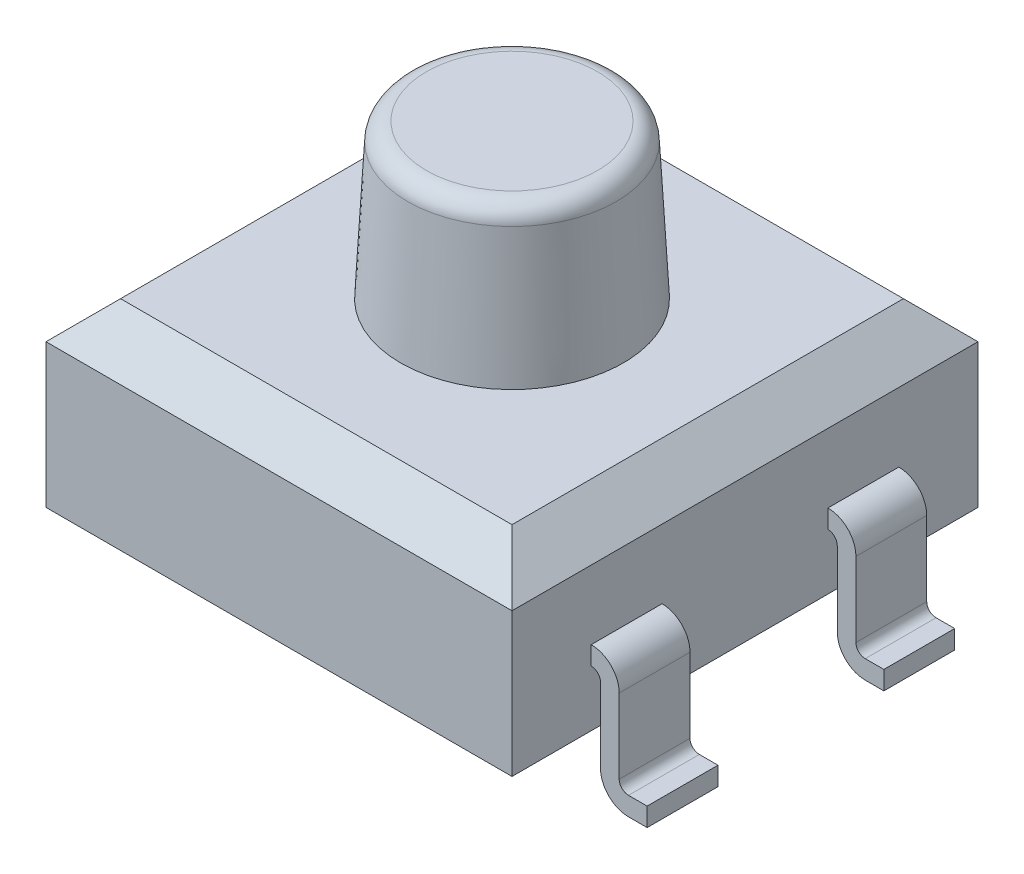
from build123d import *

# Parameters (mm, degrees)
SKETCH_1_W      = 5
SKETCH_1_H      = 2.34
EXTRUDE_1_DEPTH = 2.5
EXTRUDE_START   = 1.27
EXTRUDE_2_DEPTH = 0.38
SKETCH_3_R      = 1.195
EXTRUDE_3_DEPTH = 1.65
EXTRUDE_3_TAPER = 3
CHAMFER_1_SIZE  = 0.4
FILLET_1_R      = 0.2


with BuildPart() as part:
    # Sketch 1 → Extrude 1 (new, symmetric)
    with BuildSketch(Plane(origin=(0, 0, 0), x_dir=(0, 0, -1), z_dir=(1, 0, 0))):
        with Locations((0, 1.37)):
            Rectangle(SKETCH_1_W, SKETCH_1_H)
    extrude(amount=EXTRUDE_1_DEPTH, both=True)

    # Sketch 2 → Extrude 2 (add, symmetric)
    with BuildSketch(Plane(origin=(-1.27, 0, 0), x_dir=(1, 0, 0), z_dir=(0, 0, 1)).offset(EXTRUDE_START)):
        with BuildLine():
            Line((-1.23, 1.2), (3.77, 1.2))
            ThreePointArc((3.77, 1.2), (3.840710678, 1.170710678), (3.87, 1.1))
            Line((3.87, 1.1), (3.87, 0.3))
            ThreePointArc((3.87, 0.3), (3.957867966, 0.087867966), (4.17, 0))
            Line((4.17, 0), (4.37, 0))
            Line((4.37, 0), (4.37, 0.2))
            Line((4.37, 0.2), (4.17, 0.2))
            ThreePointArc((4.17, 0.2), (4.099289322, 0.229289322), (4.07, 0.3))
            Line((4.07, 0.3), (4.07, 1.1))
            ThreePointArc((4.07, 1.1), (3.982132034, 1.312132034), (3.77, 1.4))
            Line((3.77, 1.4), (-1.23, 1.4))
            ThreePointArc((-1.23, 1.4), (-1.442132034, 1.312132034), (-1.53, 1.1))
            Line((-1.53, 1.1), (-1.53, 0.3))
            ThreePointArc((-1.53, 0.3), (-1.559289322, 0.229289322), (-1.63, 0.2))
            Line((-1.63, 0.2), (-1.83, 0.2))
            Line((-1.83, 0.2), (-1.83, 0))
            Line((-1.83, 0), (-1.63, 0))
            ThreePointArc((-1.63, 0), (-1.417867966, 0.087867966), (-1.33, 0.3))
            Line((-1.33, 0.3), (-1.33, 1.1))
            ThreePointArc((-1.33, 1.1), (-1.300710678, 1.170710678), (-1.23, 1.2))
        make_face()
    extrude_2 = extrude(amount=EXTRUDE_2_DEPTH, both=True)

    # Mirror 1: Extrude 2 across plane
    add(extrude_2.mirror(Plane.XY))

    # Sketch 3 → Extrude 3 (add)
    with BuildSketch(Plane(origin=(0, 2.54, 0), x_dir=(-1, 0, 0), z_dir=(0, 1, 0))):
        Circle(SKETCH_3_R)
    extrude(amount=EXTRUDE_3_DEPTH, taper=EXTRUDE_3_TAPER)

    # Chamfer 1
    chamfer_1_edges = [part.edges().sort_by_distance(p)[0] for p in [
        (2.5, 2.54, 0),
        (-2.5, 2.54, 0),
        (-2.5, 0.2, 0),
        (2.5, 0.2, 0),
        (0, 2.54, 2.5),
        (0, 2.54, -2.5),
        (0, 0.2, -2.5),
        (0, 0.2, 2.5),
    ]]
    chamfer(chamfer_1_edges, length=CHAMFER_1_SIZE)

    # Fillet 1
    fillet_1_edges = [part.edges().sort_by_distance(p)[0] for p in [
        (1.108527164, 4.19, 0),
    ]]
    fillet(fillet_1_edges, radius=FILLET_1_R)


solid = part.part
